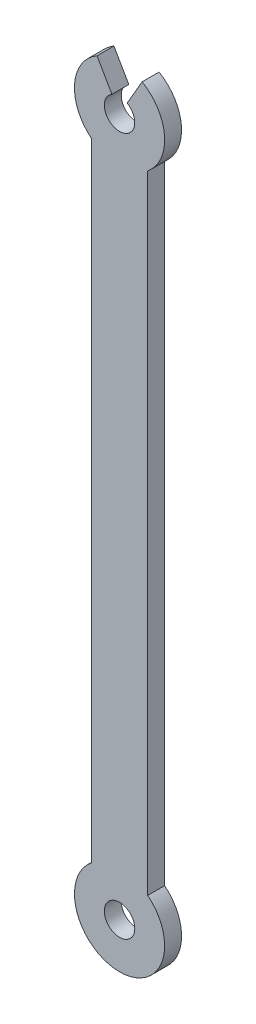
from build123d import *

# Parameters (mm, degrees)
SKETCH_1_R      = 1.35
EXTRUDE_1_DEPTH = 1.5


with BuildPart() as part:
    # Sketch 1 → Extrude 1 (new body)
    with BuildSketch(Plane.XY):
        with BuildLine():
            Line((-2.5, -3.122498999), (-2.5, -58.777501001))
            ThreePointArc((-2.5, -58.777501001), (0, -65.9), (2.5, -58.777501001))
            Line((2.5, -58.777501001), (2.5, -3.122498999))
            ThreePointArc((2.5, -3.122498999), (3.988524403, 0.302775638), (2, 3.464101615))
            Line((2, 3.464101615), (0.675, 1.169134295))
            ThreePointArc((0.675, 1.169134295), (1.169134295, 0.675), (1.35, 0))
            ThreePointArc((1.35, 0), (-0.675, -1.169134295), (-0.675, 1.169134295))
            Line((-0.675, 1.169134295), (-2, 3.464101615))
            ThreePointArc((-2, 3.464101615), (-3.988524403, 0.302775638), (-2.5, -3.122498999))
        make_face()
        with Locations((0, -61.9)):
            Circle(SKETCH_1_R, mode=Mode.SUBTRACT)
    extrude(amount=EXTRUDE_1_DEPTH)


solid = part.part
